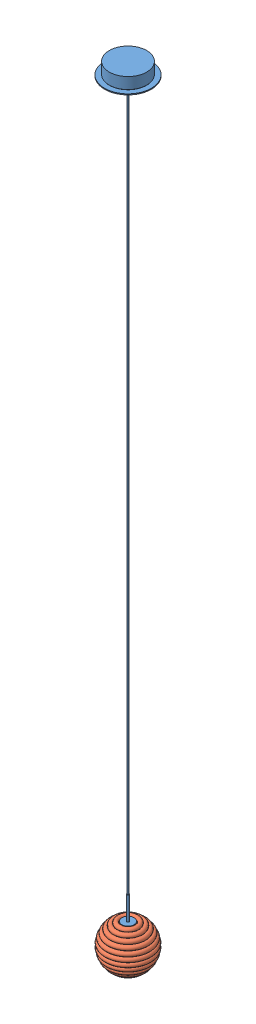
SolidWorks assembly Ensamblaje2.sldasm, configuration Predeterminado (file format 11000). Lengths in mm.
Overall size (110 1741 100).
2 component instances, 2 part files, 2 mates.
Components (placement in the parent):
- ESTRUCTURA_COLGANTE_SENCILLO_DOUL_C1310-1: ESTRUCTURA_COLGANTE_SENCILLO_DOUL_C1310.SLDPRT [Predeterminado] at (-220.9331 745.6365 1649) size (110 1649 100)
- CABEZAL_DOUL_C1310-1: CABEZAL_DOUL_C1310.SLDPRT [Predeterminado] at (-220.9331 -865.3635 1649) size (99.51 96.11 99.51)
Mates (geometry in assembly coordinates):
- Concéntrica1: concentric: circle of ESTRUCTURA_COLGANTE_SENCILLO_DOUL_C1310-1; circle of ?
- Coincidente1: coincident: plane of assembly; plane of assembly; plane of ESTRUCTURA_COLGANTE_SENCILLO_DOUL_C1310-1 through (-220.9331 -823.3635 1649) normal (0 -1 0); plane of CABEZAL_DOUL_C1310-1 through (-220.9331 -823.3635 1649) normal (0 1 0)
